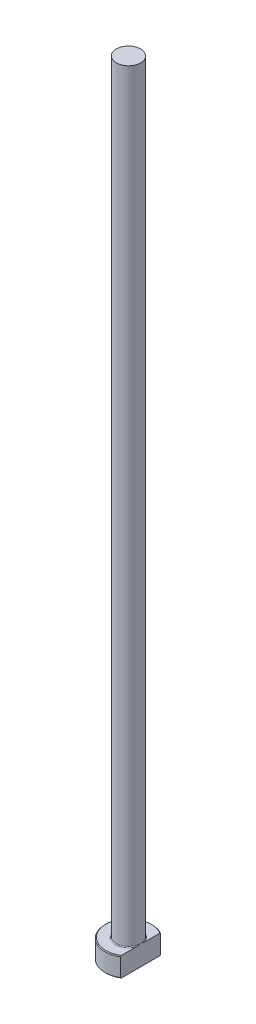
from build123d import *
from build123d.topology import SkipClean

# Parameters (mm, degrees)
CHAMFER1_SIZE = 0.2
FILLET1_R     = 0.2
KEY_DEPTH     = 201.179919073


with BuildPart() as part:
    # Sketch1 → Revolve1 (revolve)
    with BuildSketch(Plane.XY, mode=Mode.PRIVATE) as revolve1_sk:
        Polygon((0, 0), (-6, 0), (-6, 5), (-3.1, 5), (-3.1, 200), (0, 200), align=None)
    revolve(revolve1_sk.sketch.rotate(Axis((0, 259.958771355, 0), (0, -1, 0)), 270), axis=Axis((0, 259.958771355, 0), (0, -1, 0)))

    # Chamfer1
    chamfer1_edges = [part.edges().sort_by_distance(p)[0] for p in [
        (0, 5, -6),
        (0, 0, -6),
    ]]
    chamfer(chamfer1_edges, length=CHAMFER1_SIZE)

    # Fillet1
    fillet1_edges = [part.edges().sort_by_distance(p)[0] for p in [
        (0, 5, -3.1),
    ]]
    fillet(fillet1_edges, radius=FILLET1_R)

    # Sketch2 → KEY (cut, through all)
    with SkipClean():  # the faces are left unmerged after this step: merging them gives an invalid solid
        with BuildSketch(Plane(origin=(0, 0, 0), x_dir=(1, 0, 0), z_dir=(0, 1, 0))):
            with BuildLine():
                Line((3.1, 5.137119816), (3.1, -5.137119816))
                ThreePointArc((3.1, -5.137119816), (6, 0), (3.1, 5.137119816))
            make_face()
        extrude(amount=KEY_DEPTH, mode=Mode.SUBTRACT)


solid = part.part
